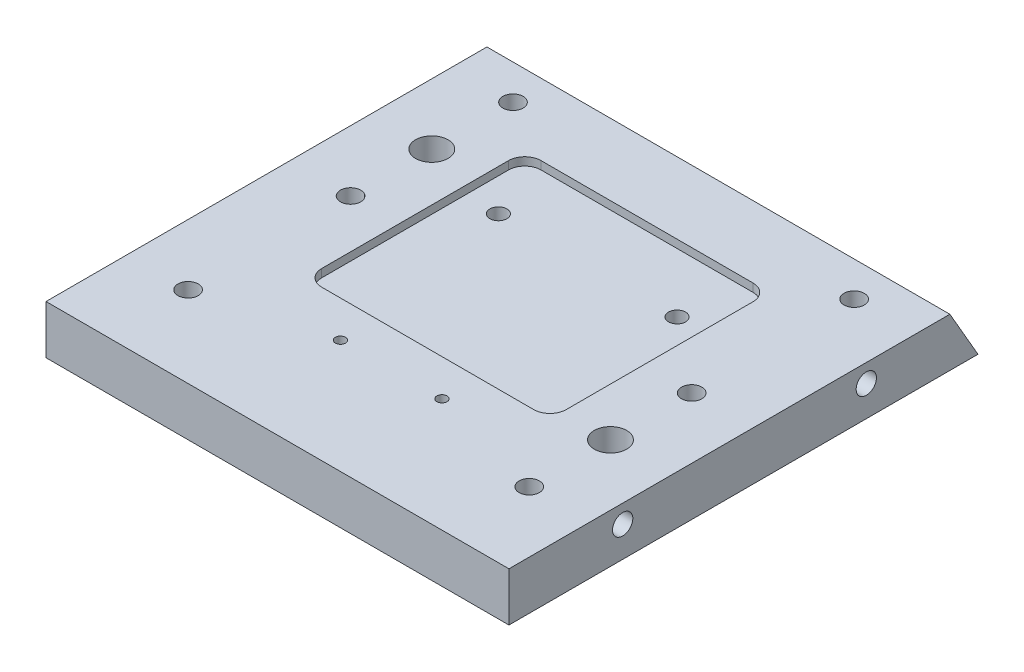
from build123d import *

# Parameters (mm, degrees)
BOSS_EXTRUDE1_DEPTH       = 57
M6X1_0_TAPPED_HOLE1_D     = 5
M6X1_0_TAPPED_HOLE2_D     = 5
M6X1_0_TAPPED_HOLE2_DEPTH = 15
M6X1_0_TAPPED_HOLE2_TIP   = 1.502151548
M6X1_0_TAPPED_HOLE3_D     = 5
M6X1_0_TAPPED_HOLE3_DEPTH = 15
M6X1_0_TAPPED_HOLE3_TIP   = 1.502151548
M5X0_8_TAPPED_HOLE1_D     = 4.2
SKETCH20_W                = 60.2
SKETCH20_H                = 54
CUT_EXTRUDE1_DEPTH        = 2
F_8_0_8_DIAMETER_HOLE1_D  = 8
FILLET1_R                 = 4
M3X0_5_TAPPED_HOLE1_D     = 2.5
M3X0_5_TAPPED_HOLE1_DEPTH = 7.5
M3X0_5_TAPPED_HOLE1_TIP   = 0.751075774
M3X0_5_TAPPED_HOLE2_D     = 2.5


with BuildPart() as part:
    # Sketch1 → Boss-Extrude1 (new, symmetric)
    with BuildSketch(Plane(origin=(0, 0, 0), x_dir=(0, 0, -1), z_dir=(1, 0, 0))):
        Polygon((0, 0), (115.5, 0), (108.57179677, 12), (0, 12), align=None)
    extrude(amount=BOSS_EXTRUDE1_DEPTH, both=True)

    # M6x1.0 Tapped Hole1 (through all)
    with Locations(Plane(origin=(0, 0, 0), x_dir=(-1, 0, 0), z_dir=(0, -1, 0))):
        with Locations((42, 20), (42, 60), (42, 100), (-42, 100), (-42, 60), (-42, 20)):
            Hole(M6X1_0_TAPPED_HOLE1_D / 2)

    # M6x1.0 Tapped Hole2
    with Locations(Plane(origin=(57, 0, 0), x_dir=(0, 0, -1), z_dir=(1, 0, 0))):
        with Locations((88, 7.5), (28, 7.5)):
            Hole(M6X1_0_TAPPED_HOLE2_D / 2, depth=M6X1_0_TAPPED_HOLE2_DEPTH)
            with Locations((0, 0, -(M6X1_0_TAPPED_HOLE2_DEPTH + M6X1_0_TAPPED_HOLE2_TIP / 2))):  # 118° drill point
                Cone(0, M6X1_0_TAPPED_HOLE2_D / 2, M6X1_0_TAPPED_HOLE2_TIP, mode=Mode.SUBTRACT)

    # M6x1.0 Tapped Hole3
    with Locations(Plane.ZY.offset(57)):
        with Locations((-88, 7.5), (-28, 7.5)):
            Hole(M6X1_0_TAPPED_HOLE3_D / 2, depth=M6X1_0_TAPPED_HOLE3_DEPTH)
            with Locations((0, 0, -(M6X1_0_TAPPED_HOLE3_DEPTH + M6X1_0_TAPPED_HOLE3_TIP / 2))):  # 118° drill point
                Cone(0, M6X1_0_TAPPED_HOLE3_D / 2, M6X1_0_TAPPED_HOLE3_TIP, mode=Mode.SUBTRACT)

    # M5x0.8 Tapped Hole1 (through all)
    with Locations(Plane(origin=(0, 12, 0), x_dir=(1, 0, 0), z_dir=(0, 1, 0))):
        with Locations((-22, 76.4), (22, 76.4)):
            Hole(M5X0_8_TAPPED_HOLE1_D / 2)

    # Sketch20 → Cut-Extrude1 (cut)
    with BuildSketch(Plane(origin=(0, 12, 0), x_dir=(1, 0, 0), z_dir=(0, 1, 0))):
        with Locations((0, 64)):
            Rectangle(SKETCH20_W, SKETCH20_H)
    extrude(amount=-CUT_EXTRUDE1_DEPTH, mode=Mode.SUBTRACT)

    # 8.0 _8_ Diameter Hole1 (through all)
    with Locations(Plane(origin=(0, 0, 0), x_dir=(-1, 0, 0), z_dir=(0, -1, 0))):
        with Locations((42, 80), (-42, 40)):
            Hole(F_8_0_8_DIAMETER_HOLE1_D / 2)

    # Fillet1
    fillet1_edges = [part.edges().sort_by_distance(p)[0] for p in [
        (-30.1, 11, -37),
        (-30.1, 11, -91),
        (30.1, 11, -91),
        (30.1, 11, -37),
    ]]
    fillet(fillet1_edges, radius=FILLET1_R)

    # M3x0.5 Tapped Hole1
    with Locations(Plane(origin=(0, 50.012967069, -86.625), x_dir=(-1, 0, 0), z_dir=(0, 0.5000000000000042, -0.8660254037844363))):
        with Locations((-47, -51.75), (47, -51.75)):
            Hole(M3X0_5_TAPPED_HOLE1_D / 2, depth=M3X0_5_TAPPED_HOLE1_DEPTH)
            with Locations((0, 0, -(M3X0_5_TAPPED_HOLE1_DEPTH + M3X0_5_TAPPED_HOLE1_TIP / 2))):  # 118° drill point
                Cone(0, M3X0_5_TAPPED_HOLE1_D / 2, M3X0_5_TAPPED_HOLE1_TIP, mode=Mode.SUBTRACT)

    # M3x0.5 Tapped Hole2 (through all)
    with Locations(Plane(origin=(0, 0, 0), x_dir=(-1, 0, 0), z_dir=(0, -1, 0))):
        with Locations((-12.5, 28), (12.5, 28)):
            Hole(M3X0_5_TAPPED_HOLE2_D / 2)


solid = part.part
